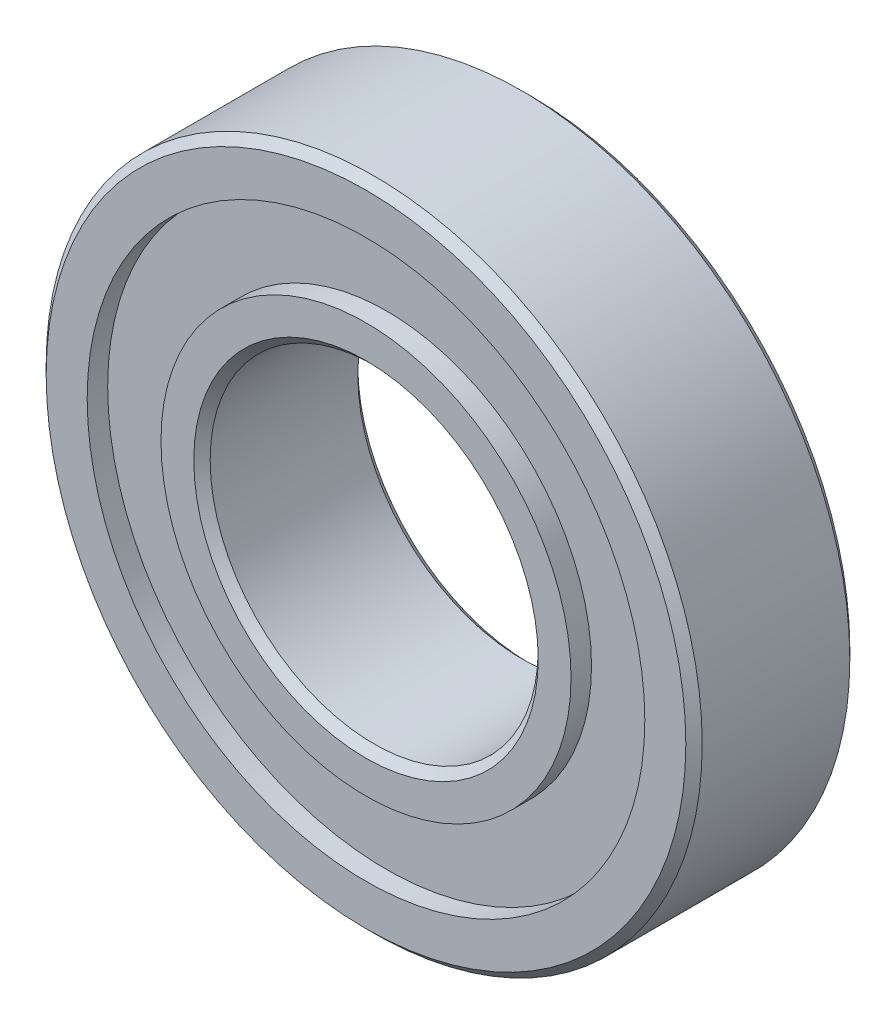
from build123d import *

# Parameters (mm, degrees)
FASE1_SIZE = 0.1


with BuildPart() as part:
    # Skizze2 → Rotation1 (revolve)
    with BuildSketch(Plane(origin=(0, 0, 0), x_dir=(0, 0, -1), z_dir=(1, 0, 0)), mode=Mode.PRIVATE) as rotation1_sk:
        Polygon((-1, 2), (1, 2), (1, 2.5), (0.75, 2.5), (0.75, 3.4), (1, 3.4), (1, 4), (-1, 4), (-1, 3.4), (-0.75, 3.4), (-0.75, 2.5), (-1, 2.5), align=None)
    revolve(rotation1_sk.sketch.rotate(Axis((0, 0, 11.845846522), (0, 0, -1)), 90), axis=Axis((0, 0, 11.845846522), (0, 0, -1)))

    # Fase1
    fase1_edges = [part.edges().sort_by_distance(p)[0] for p in [
        (-4, 0, 1),
        (-4, 0, -1),
        (-2, 0, -1),
        (-2, 0, 1),
    ]]
    chamfer(fase1_edges, length=FASE1_SIZE)


solid = part.part
